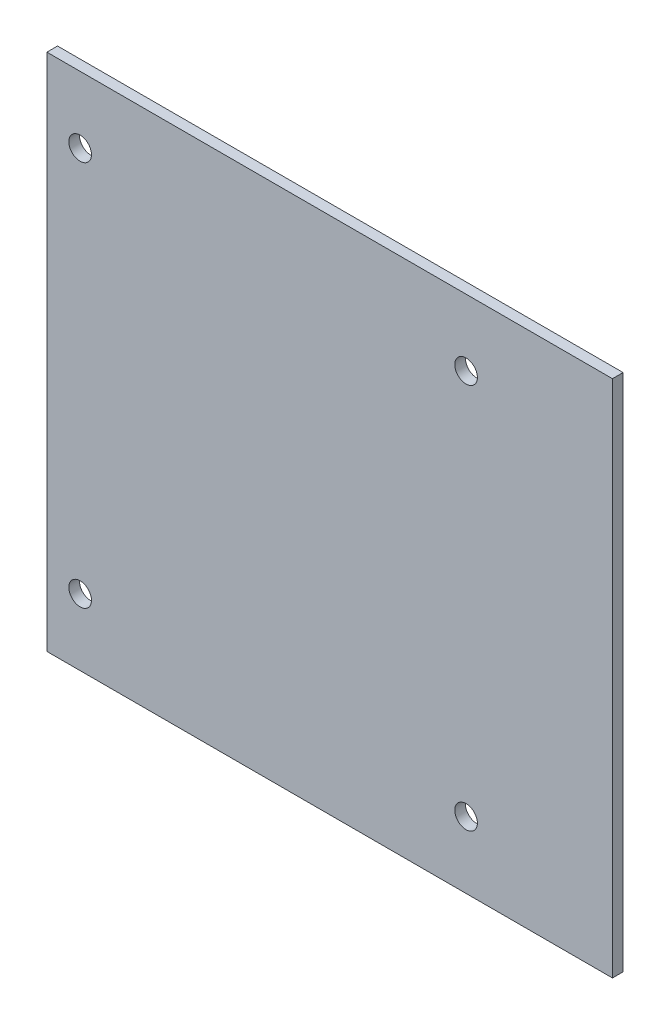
ISO-10303-21;
HEADER;
FILE_DESCRIPTION(('STEP AP214'),'2;1');
FILE_NAME('part.step','',(''),(''),'','','');
FILE_SCHEMA(('AUTOMOTIVE_DESIGN { 1 0 10303 214 1 1 1 1 }'));
ENDSEC;
DATA;
#1=APPLICATION_CONTEXT('core data for automotive mechanical design processes');
#2=APPLICATION_PROTOCOL_DEFINITION('international standard','automotive_design',2000,#1);
#3=PRODUCT_CONTEXT('',#1,'mechanical');
#4=PRODUCT('Part','Part','',(#3));
#5=PRODUCT_RELATED_PRODUCT_CATEGORY('part','',(#4));
#6=PRODUCT_DEFINITION_FORMATION('','',#4);
#7=PRODUCT_DEFINITION_CONTEXT('part definition',#1,'design');
#8=PRODUCT_DEFINITION('design','',#6,#7);
#9=PRODUCT_DEFINITION_SHAPE('','',#8);
#10=(LENGTH_UNIT() NAMED_UNIT(*) SI_UNIT(.MILLI.,.METRE.));
#11=(NAMED_UNIT(*) PLANE_ANGLE_UNIT() SI_UNIT($,.RADIAN.));
#12=(NAMED_UNIT(*) SI_UNIT($,.STERADIAN.) SOLID_ANGLE_UNIT());
#13=UNCERTAINTY_MEASURE_WITH_UNIT(LENGTH_MEASURE(1.E-05),#10,'distance_accuracy_value','');
#14=(GEOMETRIC_REPRESENTATION_CONTEXT(3) GLOBAL_UNCERTAINTY_ASSIGNED_CONTEXT((#13)) GLOBAL_UNIT_ASSIGNED_CONTEXT((#10,
#11,#12)) REPRESENTATION_CONTEXT('',''));
#15=CARTESIAN_POINT('',(0.,0.,0.));
#16=DIRECTION('',(0.,0.,1.));
#17=DIRECTION('',(1.,0.,0.));
#18=AXIS2_PLACEMENT_3D('',#15,#16,#17);
#19=CARTESIAN_POINT('',(42.5,39.,1.6));
#20=DIRECTION('',(-1.,0.,0.));
#21=DIRECTION('',(0.,-1.,0.));
#22=AXIS2_PLACEMENT_3D('',#19,#20,#21);
#23=PLANE('',#22);
#24=DIRECTION('',(0.,1.,0.));
#25=VECTOR('',#24,1.);
#26=CARTESIAN_POINT('',(42.5,39.,0.));
#27=LINE('',#26,#25);
#28=CARTESIAN_POINT('',(42.5,-39.,0.));
#29=VERTEX_POINT('',#28);
#30=CARTESIAN_POINT('',(42.5,39.,0.));
#31=VERTEX_POINT('',#30);
#32=EDGE_CURVE('E98',#29,#31,#27,.T.);
#33=ORIENTED_EDGE('',*,*,#32,.T.);
#34=DIRECTION('',(0.,0.,-1.));
#35=VECTOR('',#34,1.);
#36=CARTESIAN_POINT('',(42.5,39.,1.6));
#37=LINE('',#36,#35);
#38=CARTESIAN_POINT('',(42.5,39.,1.6));
#39=VERTEX_POINT('',#38);
#40=EDGE_CURVE('E11',#39,#31,#37,.T.);
#41=ORIENTED_EDGE('',*,*,#40,.F.);
#42=DIRECTION('',(0.,1.,0.));
#43=VECTOR('',#42,1.);
#44=CARTESIAN_POINT('',(42.5,39.,1.6));
#45=LINE('',#44,#43);
#46=CARTESIAN_POINT('',(42.5,-39.,1.6));
#47=VERTEX_POINT('',#46);
#48=EDGE_CURVE('E86',#47,#39,#45,.T.);
#49=ORIENTED_EDGE('',*,*,#48,.F.);
#50=DIRECTION('',(0.,0.,-1.));
#51=VECTOR('',#50,1.);
#52=CARTESIAN_POINT('',(42.5,-39.,1.6));
#53=LINE('',#52,#51);
#54=EDGE_CURVE('E94',#47,#29,#53,.T.);
#55=ORIENTED_EDGE('',*,*,#54,.T.);
#56=EDGE_LOOP('',(#33,#41,#49,#55));
#57=FACE_BOUND('',#56,.T.);
#58=ADVANCED_FACE('F35',(#57),#23,.F.);
#59=CARTESIAN_POINT('',(-42.5,39.,1.6));
#60=DIRECTION('',(0.,-1.,0.));
#61=DIRECTION('',(0.,0.,-1.));
#62=AXIS2_PLACEMENT_3D('',#59,#60,#61);
#63=PLANE('',#62);
#64=DIRECTION('',(-1.,0.,0.));
#65=VECTOR('',#64,1.);
#66=CARTESIAN_POINT('',(-42.5,39.,0.));
#67=LINE('',#66,#65);
#68=CARTESIAN_POINT('',(-42.5,39.,0.));
#69=VERTEX_POINT('',#68);
#70=EDGE_CURVE('E90',#31,#69,#67,.T.);
#71=ORIENTED_EDGE('',*,*,#70,.T.);
#72=DIRECTION('',(0.,0.,-1.));
#73=VECTOR('',#72,1.);
#74=CARTESIAN_POINT('',(-42.5,39.,1.6));
#75=LINE('',#74,#73);
#76=CARTESIAN_POINT('',(-42.5,39.,1.6));
#77=VERTEX_POINT('',#76);
#78=EDGE_CURVE('E43',#77,#69,#75,.T.);
#79=ORIENTED_EDGE('',*,*,#78,.F.);
#80=DIRECTION('',(-1.,0.,0.));
#81=VECTOR('',#80,1.);
#82=CARTESIAN_POINT('',(-42.5,39.,1.6));
#83=LINE('',#82,#81);
#84=EDGE_CURVE('E81',#39,#77,#83,.T.);
#85=ORIENTED_EDGE('',*,*,#84,.F.);
#86=ORIENTED_EDGE('',*,*,#40,.T.);
#87=EDGE_LOOP('',(#71,#79,#85,#86));
#88=FACE_BOUND('',#87,.T.);
#89=ADVANCED_FACE('F89',(#88),#63,.F.);
#90=CARTESIAN_POINT('',(-42.5,39.,1.6));
#91=DIRECTION('',(1.,0.,0.));
#92=DIRECTION('',(0.,1.,0.));
#93=AXIS2_PLACEMENT_3D('',#90,#91,#92);
#94=PLANE('',#93);
#95=DIRECTION('',(0.,-1.,0.));
#96=VECTOR('',#95,1.);
#97=CARTESIAN_POINT('',(-42.5,39.,0.));
#98=LINE('',#97,#96);
#99=CARTESIAN_POINT('',(-42.5,-39.,0.));
#100=VERTEX_POINT('',#99);
#101=EDGE_CURVE('E68',#69,#100,#98,.T.);
#102=ORIENTED_EDGE('',*,*,#101,.T.);
#103=DIRECTION('',(0.,0.,-1.));
#104=VECTOR('',#103,1.);
#105=CARTESIAN_POINT('',(-42.5,-39.,1.6));
#106=LINE('',#105,#104);
#107=CARTESIAN_POINT('',(-42.5,-39.,1.6));
#108=VERTEX_POINT('',#107);
#109=EDGE_CURVE('E91',#108,#100,#106,.T.);
#110=ORIENTED_EDGE('',*,*,#109,.F.);
#111=DIRECTION('',(0.,-1.,0.));
#112=VECTOR('',#111,1.);
#113=CARTESIAN_POINT('',(-42.5,39.,1.6));
#114=LINE('',#113,#112);
#115=EDGE_CURVE('E84',#77,#108,#114,.T.);
#116=ORIENTED_EDGE('',*,*,#115,.F.);
#117=ORIENTED_EDGE('',*,*,#78,.T.);
#118=EDGE_LOOP('',(#102,#110,#116,#117));
#119=FACE_BOUND('',#118,.T.);
#120=ADVANCED_FACE('F92',(#119),#94,.F.);
#121=CARTESIAN_POINT('',(-42.5,-39.,1.6));
#122=DIRECTION('',(0.,1.,0.));
#123=DIRECTION('',(0.,0.,1.));
#124=AXIS2_PLACEMENT_3D('',#121,#122,#123);
#125=PLANE('',#124);
#126=DIRECTION('',(1.,0.,0.));
#127=VECTOR('',#126,1.);
#128=CARTESIAN_POINT('',(-42.5,-39.,0.));
#129=LINE('',#128,#127);
#130=EDGE_CURVE('E74',#100,#29,#129,.T.);
#131=ORIENTED_EDGE('',*,*,#130,.T.);
#132=ORIENTED_EDGE('',*,*,#54,.F.);
#133=DIRECTION('',(1.,0.,0.));
#134=VECTOR('',#133,1.);
#135=CARTESIAN_POINT('',(-42.5,-39.,1.6));
#136=LINE('',#135,#134);
#137=EDGE_CURVE('E51',#108,#47,#136,.T.);
#138=ORIENTED_EDGE('',*,*,#137,.F.);
#139=ORIENTED_EDGE('',*,*,#109,.T.);
#140=EDGE_LOOP('',(#131,#132,#138,#139));
#141=FACE_BOUND('',#140,.T.);
#142=ADVANCED_FACE('F106',(#141),#125,.F.);
#143=CARTESIAN_POINT('',(0.,0.,1.6));
#144=DIRECTION('',(0.,0.,1.));
#145=DIRECTION('',(1.,0.,0.));
#146=AXIS2_PLACEMENT_3D('',#143,#144,#145);
#147=PLANE('',#146);
#148=CARTESIAN_POINT('',(20.4999982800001,-29.0000011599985,1.6));
#149=DIRECTION('',(0.,0.,-1.));
#150=DIRECTION('',(-1.,0.,0.));
#151=AXIS2_PLACEMENT_3D('',#148,#149,#150);
#152=CIRCLE('',#151,1.7);
#153=CARTESIAN_POINT('',(18.7999982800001,-29.0000011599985,1.6));
#154=VERTEX_POINT('',#153);
#155=EDGE_CURVE('E115',#154,#154,#152,.T.);
#156=ORIENTED_EDGE('',*,*,#155,.T.);
#157=EDGE_LOOP('',(#156));
#158=FACE_BOUND('',#157,.T.);
#159=CARTESIAN_POINT('',(-37.5000000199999,28.9999996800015,1.6));
#160=DIRECTION('',(0.,0.,-1.));
#161=DIRECTION('',(-1.,0.,0.));
#162=AXIS2_PLACEMENT_3D('',#159,#160,#161);
#163=CIRCLE('',#162,1.7);
#164=CARTESIAN_POINT('',(-39.2000000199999,28.9999996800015,1.6));
#165=VERTEX_POINT('',#164);
#166=EDGE_CURVE('E127',#165,#165,#163,.T.);
#167=ORIENTED_EDGE('',*,*,#166,.T.);
#168=EDGE_LOOP('',(#167));
#169=FACE_BOUND('',#168,.T.);
#170=CARTESIAN_POINT('',(20.4999982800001,28.9999996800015,1.6));
#171=DIRECTION('',(0.,0.,-1.));
#172=DIRECTION('',(-1.,0.,0.));
#173=AXIS2_PLACEMENT_3D('',#170,#171,#172);
#174=CIRCLE('',#173,1.7);
#175=CARTESIAN_POINT('',(18.7999982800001,28.9999996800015,1.6));
#176=VERTEX_POINT('',#175);
#177=EDGE_CURVE('E121',#176,#176,#174,.T.);
#178=ORIENTED_EDGE('',*,*,#177,.T.);
#179=EDGE_LOOP('',(#178));
#180=FACE_BOUND('',#179,.T.);
#181=CARTESIAN_POINT('',(-37.5000025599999,-29.0000011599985,1.6));
#182=DIRECTION('',(0.,0.,-1.));
#183=DIRECTION('',(-1.,0.,0.));
#184=AXIS2_PLACEMENT_3D('',#181,#182,#183);
#185=CIRCLE('',#184,1.7);
#186=CARTESIAN_POINT('',(-39.2000025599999,-29.0000011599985,1.6));
#187=VERTEX_POINT('',#186);
#188=EDGE_CURVE('E101',#187,#187,#185,.T.);
#189=ORIENTED_EDGE('',*,*,#188,.T.);
#190=EDGE_LOOP('',(#189));
#191=FACE_BOUND('',#190,.T.);
#192=ORIENTED_EDGE('',*,*,#48,.T.);
#193=ORIENTED_EDGE('',*,*,#84,.T.);
#194=ORIENTED_EDGE('',*,*,#115,.T.);
#195=ORIENTED_EDGE('',*,*,#137,.T.);
#196=EDGE_LOOP('',(#192,#193,#194,#195));
#197=FACE_BOUND('',#196,.T.);
#198=ADVANCED_FACE('F82',(#158,#169,#180,#191,#197),#147,.T.);
#199=CARTESIAN_POINT('',(0.,0.,0.));
#200=DIRECTION('',(0.,0.,1.));
#201=DIRECTION('',(1.,0.,0.));
#202=AXIS2_PLACEMENT_3D('',#199,#200,#201);
#203=PLANE('',#202);
#204=CARTESIAN_POINT('',(20.4999982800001,-29.0000011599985,0.));
#205=DIRECTION('',(0.,0.,-1.));
#206=DIRECTION('',(-1.,0.,0.));
#207=AXIS2_PLACEMENT_3D('',#204,#205,#206);
#208=CIRCLE('',#207,1.7);
#209=CARTESIAN_POINT('',(18.7999982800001,-29.0000011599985,0.));
#210=VERTEX_POINT('',#209);
#211=EDGE_CURVE('E130',#210,#210,#208,.T.);
#212=ORIENTED_EDGE('',*,*,#211,.F.);
#213=EDGE_LOOP('',(#212));
#214=FACE_BOUND('',#213,.T.);
#215=CARTESIAN_POINT('',(-37.5000000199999,28.9999996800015,0.));
#216=DIRECTION('',(0.,0.,-1.));
#217=DIRECTION('',(-1.,0.,0.));
#218=AXIS2_PLACEMENT_3D('',#215,#216,#217);
#219=CIRCLE('',#218,1.7);
#220=CARTESIAN_POINT('',(-39.2000000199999,28.9999996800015,0.));
#221=VERTEX_POINT('',#220);
#222=EDGE_CURVE('E124',#221,#221,#219,.T.);
#223=ORIENTED_EDGE('',*,*,#222,.F.);
#224=EDGE_LOOP('',(#223));
#225=FACE_BOUND('',#224,.T.);
#226=CARTESIAN_POINT('',(20.4999982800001,28.9999996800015,0.));
#227=DIRECTION('',(0.,0.,-1.));
#228=DIRECTION('',(-1.,0.,0.));
#229=AXIS2_PLACEMENT_3D('',#226,#227,#228);
#230=CIRCLE('',#229,1.7);
#231=CARTESIAN_POINT('',(18.7999982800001,28.9999996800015,0.));
#232=VERTEX_POINT('',#231);
#233=EDGE_CURVE('E118',#232,#232,#230,.T.);
#234=ORIENTED_EDGE('',*,*,#233,.F.);
#235=EDGE_LOOP('',(#234));
#236=FACE_BOUND('',#235,.T.);
#237=CARTESIAN_POINT('',(-37.5000025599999,-29.0000011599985,0.));
#238=DIRECTION('',(0.,0.,-1.));
#239=DIRECTION('',(-1.,0.,0.));
#240=AXIS2_PLACEMENT_3D('',#237,#238,#239);
#241=CIRCLE('',#240,1.7);
#242=CARTESIAN_POINT('',(-39.2000025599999,-29.0000011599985,0.));
#243=VERTEX_POINT('',#242);
#244=EDGE_CURVE('E112',#243,#243,#241,.T.);
#245=ORIENTED_EDGE('',*,*,#244,.F.);
#246=EDGE_LOOP('',(#245));
#247=FACE_BOUND('',#246,.T.);
#248=ORIENTED_EDGE('',*,*,#32,.F.);
#249=ORIENTED_EDGE('',*,*,#130,.F.);
#250=ORIENTED_EDGE('',*,*,#101,.F.);
#251=ORIENTED_EDGE('',*,*,#70,.F.);
#252=EDGE_LOOP('',(#248,#249,#250,#251));
#253=FACE_BOUND('',#252,.T.);
#254=ADVANCED_FACE('F109',(#214,#225,#236,#247,#253),#203,.F.);
#255=CARTESIAN_POINT('',(-37.5000025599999,-29.0000011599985,1.6));
#256=DIRECTION('',(0.,0.,-1.));
#257=DIRECTION('',(-1.,0.,0.));
#258=AXIS2_PLACEMENT_3D('',#255,#256,#257);
#259=CYLINDRICAL_SURFACE('',#258,1.7);
#260=ORIENTED_EDGE('',*,*,#188,.F.);
#261=EDGE_LOOP('',(#260));
#262=FACE_BOUND('',#261,.T.);
#263=ORIENTED_EDGE('',*,*,#244,.T.);
#264=EDGE_LOOP('',(#263));
#265=FACE_BOUND('',#264,.T.);
#266=ADVANCED_FACE('F147',(#262,#265),#259,.F.);
#267=CARTESIAN_POINT('',(20.4999982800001,28.9999996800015,1.6));
#268=DIRECTION('',(0.,0.,-1.));
#269=DIRECTION('',(-1.,0.,0.));
#270=AXIS2_PLACEMENT_3D('',#267,#268,#269);
#271=CYLINDRICAL_SURFACE('',#270,1.7);
#272=ORIENTED_EDGE('',*,*,#177,.F.);
#273=EDGE_LOOP('',(#272));
#274=FACE_BOUND('',#273,.T.);
#275=ORIENTED_EDGE('',*,*,#233,.T.);
#276=EDGE_LOOP('',(#275));
#277=FACE_BOUND('',#276,.T.);
#278=ADVANCED_FACE('F156',(#274,#277),#271,.F.);
#279=CARTESIAN_POINT('',(-37.5000000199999,28.9999996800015,1.6));
#280=DIRECTION('',(0.,0.,-1.));
#281=DIRECTION('',(-1.,0.,0.));
#282=AXIS2_PLACEMENT_3D('',#279,#280,#281);
#283=CYLINDRICAL_SURFACE('',#282,1.7);
#284=ORIENTED_EDGE('',*,*,#166,.F.);
#285=EDGE_LOOP('',(#284));
#286=FACE_BOUND('',#285,.T.);
#287=ORIENTED_EDGE('',*,*,#222,.T.);
#288=EDGE_LOOP('',(#287));
#289=FACE_BOUND('',#288,.T.);
#290=ADVANCED_FACE('F141',(#286,#289),#283,.F.);
#291=CARTESIAN_POINT('',(20.4999982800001,-29.0000011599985,1.6));
#292=DIRECTION('',(0.,0.,-1.));
#293=DIRECTION('',(-1.,0.,0.));
#294=AXIS2_PLACEMENT_3D('',#291,#292,#293);
#295=CYLINDRICAL_SURFACE('',#294,1.7);
#296=ORIENTED_EDGE('',*,*,#155,.F.);
#297=EDGE_LOOP('',(#296));
#298=FACE_BOUND('',#297,.T.);
#299=ORIENTED_EDGE('',*,*,#211,.T.);
#300=EDGE_LOOP('',(#299));
#301=FACE_BOUND('',#300,.T.);
#302=ADVANCED_FACE('F138',(#298,#301),#295,.F.);
#303=CLOSED_SHELL('',(#58,#89,#120,#142,#198,#254,#266,#278,#290,#302));
#304=MANIFOLD_SOLID_BREP('B2',#303);
#305=ADVANCED_BREP_SHAPE_REPRESENTATION('',(#18,#304),#14);
#306=SHAPE_DEFINITION_REPRESENTATION(#9,#305);
ENDSEC;
END-ISO-10303-21;
